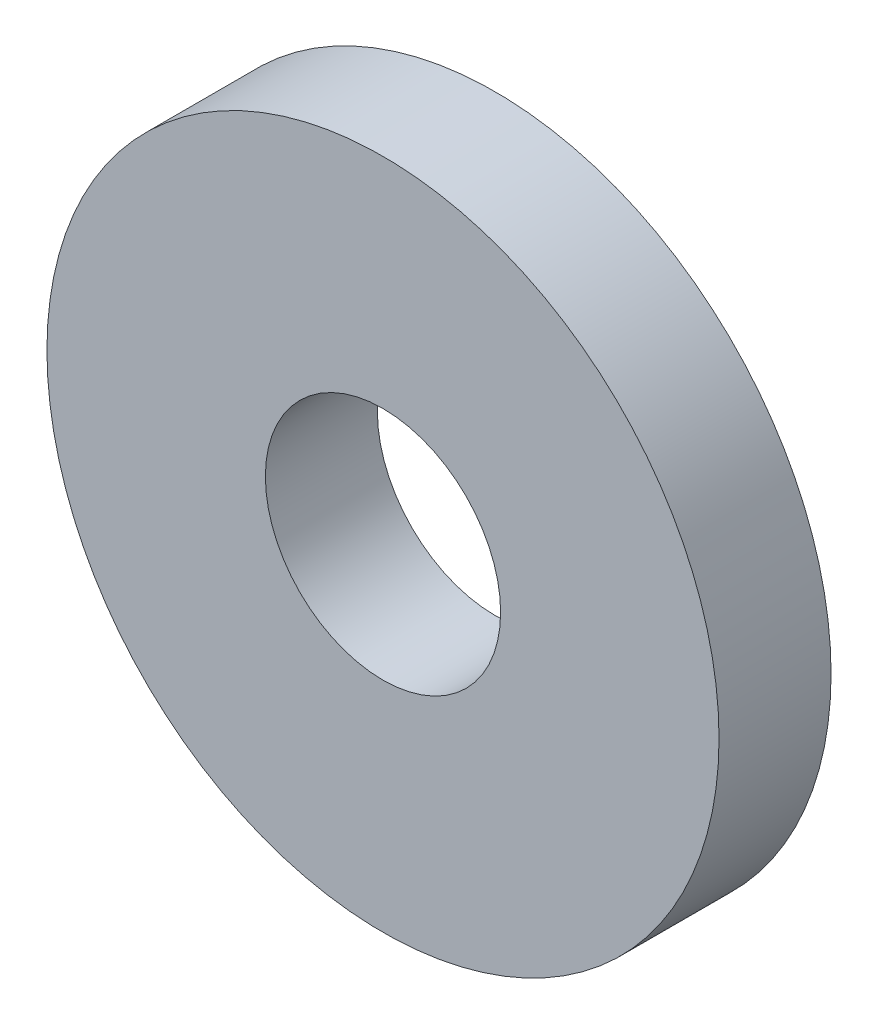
ISO-10303-21;
HEADER;
FILE_DESCRIPTION(('STEP AP214'),'2;1');
FILE_NAME('part.step','',(''),(''),'','','');
FILE_SCHEMA(('AUTOMOTIVE_DESIGN { 1 0 10303 214 1 1 1 1 }'));
ENDSEC;
DATA;
#1=APPLICATION_CONTEXT('core data for automotive mechanical design processes');
#2=APPLICATION_PROTOCOL_DEFINITION('international standard','automotive_design',2000,#1);
#3=PRODUCT_CONTEXT('',#1,'mechanical');
#4=PRODUCT('Part','Part','',(#3));
#5=PRODUCT_RELATED_PRODUCT_CATEGORY('part','',(#4));
#6=PRODUCT_DEFINITION_FORMATION('','',#4);
#7=PRODUCT_DEFINITION_CONTEXT('part definition',#1,'design');
#8=PRODUCT_DEFINITION('design','',#6,#7);
#9=PRODUCT_DEFINITION_SHAPE('','',#8);
#10=(LENGTH_UNIT() NAMED_UNIT(*) SI_UNIT(.MILLI.,.METRE.));
#11=(NAMED_UNIT(*) PLANE_ANGLE_UNIT() SI_UNIT($,.RADIAN.));
#12=(NAMED_UNIT(*) SI_UNIT($,.STERADIAN.) SOLID_ANGLE_UNIT());
#13=UNCERTAINTY_MEASURE_WITH_UNIT(LENGTH_MEASURE(1.E-05),#10,'distance_accuracy_value','');
#14=(GEOMETRIC_REPRESENTATION_CONTEXT(3) GLOBAL_UNCERTAINTY_ASSIGNED_CONTEXT((#13)) GLOBAL_UNIT_ASSIGNED_CONTEXT((#10,
#11,#12)) REPRESENTATION_CONTEXT('',''));
#15=CARTESIAN_POINT('',(0.,0.,0.));
#16=DIRECTION('',(0.,0.,1.));
#17=DIRECTION('',(1.,0.,0.));
#18=AXIS2_PLACEMENT_3D('',#15,#16,#17);
#19=CARTESIAN_POINT('',(0.,0.,5.));
#20=DIRECTION('',(0.,0.,1.));
#21=DIRECTION('',(1.,0.,0.));
#22=AXIS2_PLACEMENT_3D('',#19,#20,#21);
#23=PLANE('',#22);
#24=CARTESIAN_POINT('',(0.,0.,5.));
#25=DIRECTION('',(0.,0.,1.));
#26=DIRECTION('',(1.,0.,0.));
#27=AXIS2_PLACEMENT_3D('',#24,#25,#26);
#28=CIRCLE('',#27,15.);
#29=CARTESIAN_POINT('',(15.,0.,5.));
#30=VERTEX_POINT('',#29);
#31=EDGE_CURVE('E8',#30,#30,#28,.T.);
#32=ORIENTED_EDGE('',*,*,#31,.T.);
#33=EDGE_LOOP('',(#32));
#34=FACE_BOUND('',#33,.T.);
#35=CARTESIAN_POINT('',(0.,0.,5.));
#36=DIRECTION('',(0.,0.,1.));
#37=DIRECTION('',(1.,0.,0.));
#38=AXIS2_PLACEMENT_3D('',#35,#36,#37);
#39=CIRCLE('',#38,5.25);
#40=CARTESIAN_POINT('',(5.25,0.,5.));
#41=VERTEX_POINT('',#40);
#42=EDGE_CURVE('E23',#41,#41,#39,.T.);
#43=ORIENTED_EDGE('',*,*,#42,.F.);
#44=EDGE_LOOP('',(#43));
#45=FACE_BOUND('',#44,.T.);
#46=ADVANCED_FACE('F12',(#34,#45),#23,.T.);
#47=CARTESIAN_POINT('',(0.,0.,0.));
#48=DIRECTION('',(0.,0.,1.));
#49=DIRECTION('',(1.,0.,0.));
#50=AXIS2_PLACEMENT_3D('',#47,#48,#49);
#51=PLANE('',#50);
#52=CARTESIAN_POINT('',(0.,0.,0.));
#53=DIRECTION('',(0.,0.,1.));
#54=DIRECTION('',(1.,0.,0.));
#55=AXIS2_PLACEMENT_3D('',#52,#53,#54);
#56=CIRCLE('',#55,15.);
#57=CARTESIAN_POINT('',(15.,0.,0.));
#58=VERTEX_POINT('',#57);
#59=EDGE_CURVE('E19',#58,#58,#56,.T.);
#60=ORIENTED_EDGE('',*,*,#59,.F.);
#61=EDGE_LOOP('',(#60));
#62=FACE_BOUND('',#61,.T.);
#63=CARTESIAN_POINT('',(0.,0.,0.));
#64=DIRECTION('',(0.,0.,1.));
#65=DIRECTION('',(1.,0.,0.));
#66=AXIS2_PLACEMENT_3D('',#63,#64,#65);
#67=CIRCLE('',#66,5.25);
#68=CARTESIAN_POINT('',(5.25,0.,0.));
#69=VERTEX_POINT('',#68);
#70=EDGE_CURVE('E27',#69,#69,#67,.T.);
#71=ORIENTED_EDGE('',*,*,#70,.T.);
#72=EDGE_LOOP('',(#71));
#73=FACE_BOUND('',#72,.T.);
#74=ADVANCED_FACE('F33',(#62,#73),#51,.F.);
#75=CARTESIAN_POINT('',(0.,0.,5.));
#76=DIRECTION('',(0.,0.,-1.));
#77=DIRECTION('',(-1.,0.,0.));
#78=AXIS2_PLACEMENT_3D('',#75,#76,#77);
#79=CYLINDRICAL_SURFACE('',#78,15.);
#80=ORIENTED_EDGE('',*,*,#31,.F.);
#81=EDGE_LOOP('',(#80));
#82=FACE_BOUND('',#81,.T.);
#83=ORIENTED_EDGE('',*,*,#59,.T.);
#84=EDGE_LOOP('',(#83));
#85=FACE_BOUND('',#84,.T.);
#86=ADVANCED_FACE('F14',(#82,#85),#79,.T.);
#87=CARTESIAN_POINT('',(0.,0.,5.));
#88=DIRECTION('',(0.,0.,-1.));
#89=DIRECTION('',(-1.,0.,0.));
#90=AXIS2_PLACEMENT_3D('',#87,#88,#89);
#91=CYLINDRICAL_SURFACE('',#90,5.25);
#92=ORIENTED_EDGE('',*,*,#42,.T.);
#93=EDGE_LOOP('',(#92));
#94=FACE_BOUND('',#93,.T.);
#95=ORIENTED_EDGE('',*,*,#70,.F.);
#96=EDGE_LOOP('',(#95));
#97=FACE_BOUND('',#96,.T.);
#98=ADVANCED_FACE('F35',(#94,#97),#91,.F.);
#99=CLOSED_SHELL('',(#46,#74,#86,#98));
#100=MANIFOLD_SOLID_BREP('B1',#99);
#101=ADVANCED_BREP_SHAPE_REPRESENTATION('',(#18,#100),#14);
#102=SHAPE_DEFINITION_REPRESENTATION(#9,#101);
ENDSEC;
END-ISO-10303-21;
